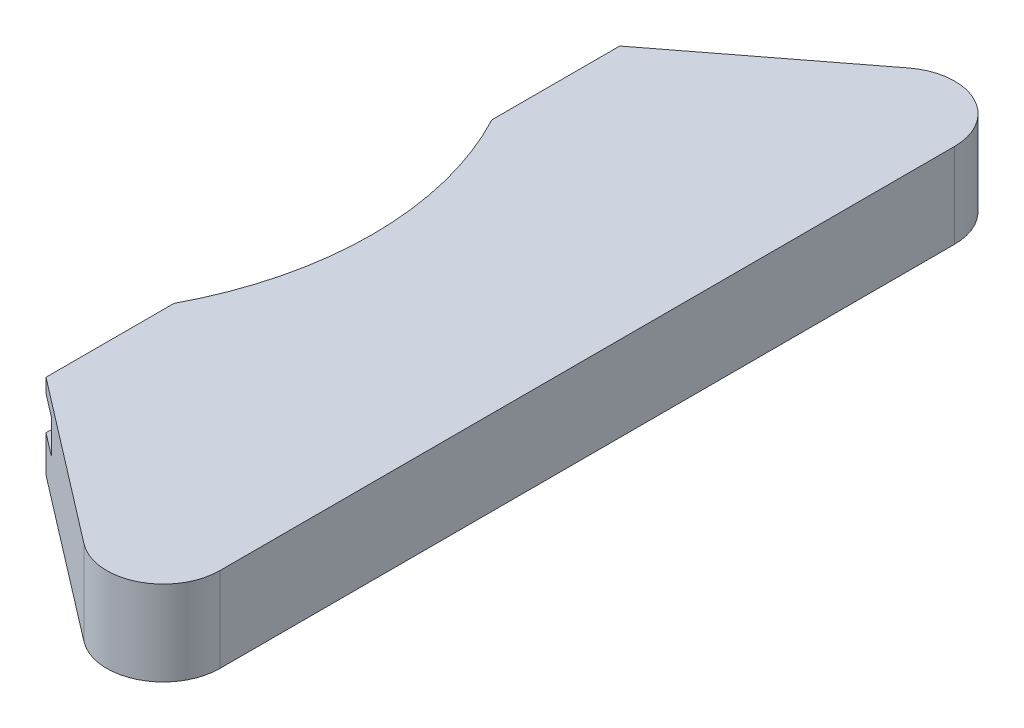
ISO-10303-21;
HEADER;
FILE_DESCRIPTION(('STEP AP214'),'2;1');
FILE_NAME('part.step','',(''),(''),'','','');
FILE_SCHEMA(('AUTOMOTIVE_DESIGN { 1 0 10303 214 1 1 1 1 }'));
ENDSEC;
DATA;
#1=APPLICATION_CONTEXT('core data for automotive mechanical design processes');
#2=APPLICATION_PROTOCOL_DEFINITION('international standard','automotive_design',2000,#1);
#3=PRODUCT_CONTEXT('',#1,'mechanical');
#4=PRODUCT('Part','Part','',(#3));
#5=PRODUCT_RELATED_PRODUCT_CATEGORY('part','',(#4));
#6=PRODUCT_DEFINITION_FORMATION('','',#4);
#7=PRODUCT_DEFINITION_CONTEXT('part definition',#1,'design');
#8=PRODUCT_DEFINITION('design','',#6,#7);
#9=PRODUCT_DEFINITION_SHAPE('','',#8);
#10=(LENGTH_UNIT() NAMED_UNIT(*) SI_UNIT(.MILLI.,.METRE.));
#11=(NAMED_UNIT(*) PLANE_ANGLE_UNIT() SI_UNIT($,.RADIAN.));
#12=(NAMED_UNIT(*) SI_UNIT($,.STERADIAN.) SOLID_ANGLE_UNIT());
#13=UNCERTAINTY_MEASURE_WITH_UNIT(LENGTH_MEASURE(1.E-05),#10,'distance_accuracy_value','');
#14=(GEOMETRIC_REPRESENTATION_CONTEXT(3) GLOBAL_UNCERTAINTY_ASSIGNED_CONTEXT((#13)) GLOBAL_UNIT_ASSIGNED_CONTEXT((#10,
#11,#12)) REPRESENTATION_CONTEXT('',''));
#15=CARTESIAN_POINT('',(0.,0.,0.));
#16=DIRECTION('',(0.,0.,1.));
#17=DIRECTION('',(1.,0.,0.));
#18=AXIS2_PLACEMENT_3D('',#15,#16,#17);
#19=CARTESIAN_POINT('',(-45.,7.5,28.1247222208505));
#20=DIRECTION('',(1.,0.,0.));
#21=DIRECTION('',(0.,0.,-1.));
#22=AXIS2_PLACEMENT_3D('',#19,#20,#21);
#23=PLANE('',#22);
#24=DIRECTION('',(0.,0.,1.));
#25=VECTOR('',#24,1.);
#26=CARTESIAN_POINT('',(-45.,-0.999999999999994,33.5516192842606));
#27=LINE('',#26,#25);
#28=CARTESIAN_POINT('',(-45.,-0.999999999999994,33.5516192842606));
#29=VERTEX_POINT('',#28);
#30=CARTESIAN_POINT('',(-45.,-0.999999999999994,50.748279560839));
#31=VERTEX_POINT('',#30);
#32=EDGE_CURVE('E144',#29,#31,#27,.T.);
#33=ORIENTED_EDGE('',*,*,#32,.F.);
#34=CARTESIAN_POINT('',(-45.,2.,33.5516192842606));
#35=DIRECTION('',(1.,0.,0.));
#36=DIRECTION('',(0.,0.,-1.));
#37=AXIS2_PLACEMENT_3D('',#34,#35,#36);
#38=ELLIPSE('',#37,3.10582854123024,2.99999999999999);
#39=CARTESIAN_POINT('',(-45.,4.99999999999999,33.5516192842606));
#40=VERTEX_POINT('',#39);
#41=EDGE_CURVE('E11',#40,#29,#38,.F.);
#42=ORIENTED_EDGE('',*,*,#41,.F.);
#43=DIRECTION('',(0.,0.,1.));
#44=VECTOR('',#43,1.);
#45=CARTESIAN_POINT('',(-45.,4.99999999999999,33.5516192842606));
#46=LINE('',#45,#44);
#47=CARTESIAN_POINT('',(-45.,4.99999999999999,50.748279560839));
#48=VERTEX_POINT('',#47);
#49=EDGE_CURVE('E121',#40,#48,#46,.T.);
#50=ORIENTED_EDGE('',*,*,#49,.T.);
#51=DIRECTION('',(0.,-1.,0.));
#52=VECTOR('',#51,1.);
#53=CARTESIAN_POINT('',(-45.,7.5,50.748279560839));
#54=LINE('',#53,#52);
#55=CARTESIAN_POINT('',(-45.,7.5,50.748279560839));
#56=VERTEX_POINT('',#55);
#57=EDGE_CURVE('E210',#56,#48,#54,.T.);
#58=ORIENTED_EDGE('',*,*,#57,.F.);
#59=DIRECTION('',(0.,0.,1.));
#60=VECTOR('',#59,1.);
#61=CARTESIAN_POINT('',(-45.,7.5,28.1247222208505));
#62=LINE('',#61,#60);
#63=CARTESIAN_POINT('',(-45.,7.5,28.1247222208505));
#64=VERTEX_POINT('',#63);
#65=EDGE_CURVE('E180',#64,#56,#62,.T.);
#66=ORIENTED_EDGE('',*,*,#65,.F.);
#67=DIRECTION('',(0.,-1.,0.));
#68=VECTOR('',#67,1.);
#69=CARTESIAN_POINT('',(-45.,7.5,28.1247222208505));
#70=LINE('',#69,#68);
#71=CARTESIAN_POINT('',(-45.,-7.5,28.1247222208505));
#72=VERTEX_POINT('',#71);
#73=EDGE_CURVE('E41',#64,#72,#70,.T.);
#74=ORIENTED_EDGE('',*,*,#73,.T.);
#75=DIRECTION('',(0.,0.,1.));
#76=VECTOR('',#75,1.);
#77=CARTESIAN_POINT('',(-45.,-7.5,28.1247222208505));
#78=LINE('',#77,#76);
#79=CARTESIAN_POINT('',(-45.,-7.5,50.748279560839));
#80=VERTEX_POINT('',#79);
#81=EDGE_CURVE('E164',#72,#80,#78,.T.);
#82=ORIENTED_EDGE('',*,*,#81,.T.);
#83=EDGE_CURVE('E146',#31,#80,#54,.T.);
#84=ORIENTED_EDGE('',*,*,#83,.F.);
#85=EDGE_LOOP('',(#33,#42,#50,#58,#66,#74,#82,#84));
#86=FACE_BOUND('',#85,.T.);
#87=ADVANCED_FACE('F31',(#86),#23,.F.);
#88=CARTESIAN_POINT('',(-45.,7.5,50.748279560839));
#89=DIRECTION('',(0.608761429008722,0.,-0.793353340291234));
#90=DIRECTION('',(-0.793353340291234,0.,-0.608761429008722));
#91=AXIS2_PLACEMENT_3D('',#88,#89,#90);
#92=PLANE('',#91);
#93=DIRECTION('',(0.793353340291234,0.,0.608761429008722));
#94=VECTOR('',#93,1.);
#95=CARTESIAN_POINT('',(-45.,-0.999999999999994,50.748279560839));
#96=LINE('',#95,#94);
#97=CARTESIAN_POINT('',(-41.,-0.999999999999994,53.8175875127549));
#98=VERTEX_POINT('',#97);
#99=EDGE_CURVE('E149',#31,#98,#96,.T.);
#100=ORIENTED_EDGE('',*,*,#99,.F.);
#101=ORIENTED_EDGE('',*,*,#83,.T.);
#102=DIRECTION('',(0.793353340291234,0.,0.608761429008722));
#103=VECTOR('',#102,1.);
#104=CARTESIAN_POINT('',(-45.,-7.5,50.748279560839));
#105=LINE('',#104,#103);
#106=CARTESIAN_POINT('',(-16.0876142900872,-7.5,72.9335334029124));
#107=VERTEX_POINT('',#106);
#108=EDGE_CURVE('E166',#80,#107,#105,.T.);
#109=ORIENTED_EDGE('',*,*,#108,.T.);
#110=DIRECTION('',(0.,-1.,0.));
#111=VECTOR('',#110,1.);
#112=CARTESIAN_POINT('',(-16.0876142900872,7.5,72.9335334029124));
#113=LINE('',#112,#111);
#114=CARTESIAN_POINT('',(-16.0876142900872,7.5,72.9335334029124));
#115=VERTEX_POINT('',#114);
#116=EDGE_CURVE('E207',#115,#107,#113,.T.);
#117=ORIENTED_EDGE('',*,*,#116,.F.);
#118=DIRECTION('',(0.793353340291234,0.,0.608761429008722));
#119=VECTOR('',#118,1.);
#120=CARTESIAN_POINT('',(-45.,7.5,50.748279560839));
#121=LINE('',#120,#119);
#122=EDGE_CURVE('E182',#56,#115,#121,.T.);
#123=ORIENTED_EDGE('',*,*,#122,.F.);
#124=ORIENTED_EDGE('',*,*,#57,.T.);
#125=DIRECTION('',(0.793353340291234,0.,0.608761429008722));
#126=VECTOR('',#125,1.);
#127=CARTESIAN_POINT('',(-45.,4.99999999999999,50.748279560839));
#128=LINE('',#127,#126);
#129=CARTESIAN_POINT('',(-41.,4.99999999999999,53.8175875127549));
#130=VERTEX_POINT('',#129);
#131=EDGE_CURVE('E128',#48,#130,#128,.T.);
#132=ORIENTED_EDGE('',*,*,#131,.T.);
#133=DIRECTION('',(0.,1.,0.));
#134=VECTOR('',#133,1.);
#135=CARTESIAN_POINT('',(-41.,-0.999999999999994,53.8175875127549));
#136=LINE('',#135,#134);
#137=EDGE_CURVE('E158',#98,#130,#136,.T.);
#138=ORIENTED_EDGE('',*,*,#137,.F.);
#139=EDGE_LOOP('',(#100,#101,#109,#117,#123,#124,#132,#138));
#140=FACE_BOUND('',#139,.T.);
#141=ADVANCED_FACE('F226',(#140),#92,.F.);
#142=CARTESIAN_POINT('',(-98.,7.5,0.));
#143=DIRECTION('',(0.,-1.,0.));
#144=DIRECTION('',(0.,0.,-1.));
#145=AXIS2_PLACEMENT_3D('',#142,#143,#144);
#146=CYLINDRICAL_SURFACE('',#145,60.);
#147=CARTESIAN_POINT('',(-98.,-7.5,0.));
#148=DIRECTION('',(0.,-1.,0.));
#149=DIRECTION('',(0.,0.,1.));
#150=AXIS2_PLACEMENT_3D('',#147,#148,#149);
#151=CIRCLE('',#150,60.);
#152=CARTESIAN_POINT('',(-45.,-7.5,-28.1247222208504));
#153=VERTEX_POINT('',#152);
#154=EDGE_CURVE('E139',#153,#72,#151,.T.);
#155=ORIENTED_EDGE('',*,*,#154,.T.);
#156=ORIENTED_EDGE('',*,*,#73,.F.);
#157=CARTESIAN_POINT('',(-98.,7.5,0.));
#158=DIRECTION('',(0.,-1.,0.));
#159=DIRECTION('',(0.,0.,1.));
#160=AXIS2_PLACEMENT_3D('',#157,#158,#159);
#161=CIRCLE('',#160,60.);
#162=CARTESIAN_POINT('',(-45.,7.5,-28.1247222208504));
#163=VERTEX_POINT('',#162);
#164=EDGE_CURVE('E178',#163,#64,#161,.T.);
#165=ORIENTED_EDGE('',*,*,#164,.F.);
#166=DIRECTION('',(0.,-1.,0.));
#167=VECTOR('',#166,1.);
#168=CARTESIAN_POINT('',(-45.,7.5,-28.1247222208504));
#169=LINE('',#168,#167);
#170=EDGE_CURVE('E192',#163,#153,#169,.T.);
#171=ORIENTED_EDGE('',*,*,#170,.T.);
#172=EDGE_LOOP('',(#155,#156,#165,#171));
#173=FACE_BOUND('',#172,.T.);
#174=ADVANCED_FACE('F33',(#173),#146,.F.);
#175=CARTESIAN_POINT('',(-10.,7.5,65.));
#176=DIRECTION('',(0.,-1.,0.));
#177=DIRECTION('',(0.,0.,-1.));
#178=AXIS2_PLACEMENT_3D('',#175,#176,#177);
#179=CYLINDRICAL_SURFACE('',#178,10.);
#180=CARTESIAN_POINT('',(-10.,-7.5,65.));
#181=DIRECTION('',(0.,1.,0.));
#182=DIRECTION('',(0.,0.,1.));
#183=AXIS2_PLACEMENT_3D('',#180,#181,#182);
#184=CIRCLE('',#183,10.);
#185=CARTESIAN_POINT('',(0.,-7.5,65.));
#186=VERTEX_POINT('',#185);
#187=EDGE_CURVE('E168',#107,#186,#184,.T.);
#188=ORIENTED_EDGE('',*,*,#187,.T.);
#189=DIRECTION('',(0.,-1.,0.));
#190=VECTOR('',#189,1.);
#191=CARTESIAN_POINT('',(0.,7.5,65.));
#192=LINE('',#191,#190);
#193=CARTESIAN_POINT('',(0.,7.5,65.));
#194=VERTEX_POINT('',#193);
#195=EDGE_CURVE('E204',#194,#186,#192,.T.);
#196=ORIENTED_EDGE('',*,*,#195,.F.);
#197=CARTESIAN_POINT('',(-10.,7.5,65.));
#198=DIRECTION('',(0.,1.,0.));
#199=DIRECTION('',(0.,0.,1.));
#200=AXIS2_PLACEMENT_3D('',#197,#198,#199);
#201=CIRCLE('',#200,10.);
#202=EDGE_CURVE('E184',#115,#194,#201,.T.);
#203=ORIENTED_EDGE('',*,*,#202,.F.);
#204=ORIENTED_EDGE('',*,*,#116,.T.);
#205=EDGE_LOOP('',(#188,#196,#203,#204));
#206=FACE_BOUND('',#205,.T.);
#207=ADVANCED_FACE('F230',(#206),#179,.T.);
#208=CARTESIAN_POINT('',(0.,7.5,65.));
#209=DIRECTION('',(-1.,0.,0.));
#210=DIRECTION('',(0.,0.,1.));
#211=AXIS2_PLACEMENT_3D('',#208,#209,#210);
#212=PLANE('',#211);
#213=DIRECTION('',(0.,0.,-1.));
#214=VECTOR('',#213,1.);
#215=CARTESIAN_POINT('',(0.,-7.5,65.));
#216=LINE('',#215,#214);
#217=CARTESIAN_POINT('',(0.,-7.5,-65.));
#218=VERTEX_POINT('',#217);
#219=EDGE_CURVE('E170',#186,#218,#216,.T.);
#220=ORIENTED_EDGE('',*,*,#219,.T.);
#221=DIRECTION('',(0.,-1.,0.));
#222=VECTOR('',#221,1.);
#223=CARTESIAN_POINT('',(0.,7.5,-65.));
#224=LINE('',#223,#222);
#225=CARTESIAN_POINT('',(0.,7.5,-65.));
#226=VERTEX_POINT('',#225);
#227=EDGE_CURVE('E201',#226,#218,#224,.T.);
#228=ORIENTED_EDGE('',*,*,#227,.F.);
#229=DIRECTION('',(0.,0.,-1.));
#230=VECTOR('',#229,1.);
#231=CARTESIAN_POINT('',(0.,7.5,65.));
#232=LINE('',#231,#230);
#233=EDGE_CURVE('E186',#194,#226,#232,.T.);
#234=ORIENTED_EDGE('',*,*,#233,.F.);
#235=ORIENTED_EDGE('',*,*,#195,.T.);
#236=EDGE_LOOP('',(#220,#228,#234,#235));
#237=FACE_BOUND('',#236,.T.);
#238=ADVANCED_FACE('F256',(#237),#212,.F.);
#239=CARTESIAN_POINT('',(-10.,7.5,-65.));
#240=DIRECTION('',(0.,-1.,0.));
#241=DIRECTION('',(0.,0.,-1.));
#242=AXIS2_PLACEMENT_3D('',#239,#240,#241);
#243=CYLINDRICAL_SURFACE('',#242,10.);
#244=CARTESIAN_POINT('',(-10.,-7.5,-65.));
#245=DIRECTION('',(0.,1.,0.));
#246=DIRECTION('',(0.,0.,-1.));
#247=AXIS2_PLACEMENT_3D('',#244,#245,#246);
#248=CIRCLE('',#247,10.);
#249=CARTESIAN_POINT('',(-16.0876142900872,-7.5,-72.9335334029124));
#250=VERTEX_POINT('',#249);
#251=EDGE_CURVE('E172',#218,#250,#248,.T.);
#252=ORIENTED_EDGE('',*,*,#251,.T.);
#253=DIRECTION('',(0.,-1.,0.));
#254=VECTOR('',#253,1.);
#255=CARTESIAN_POINT('',(-16.0876142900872,7.5,-72.9335334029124));
#256=LINE('',#255,#254);
#257=CARTESIAN_POINT('',(-16.0876142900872,7.5,-72.9335334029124));
#258=VERTEX_POINT('',#257);
#259=EDGE_CURVE('E198',#258,#250,#256,.T.);
#260=ORIENTED_EDGE('',*,*,#259,.F.);
#261=CARTESIAN_POINT('',(-10.,7.5,-65.));
#262=DIRECTION('',(0.,1.,0.));
#263=DIRECTION('',(0.,0.,-1.));
#264=AXIS2_PLACEMENT_3D('',#261,#262,#263);
#265=CIRCLE('',#264,10.);
#266=EDGE_CURVE('E188',#226,#258,#265,.T.);
#267=ORIENTED_EDGE('',*,*,#266,.F.);
#268=ORIENTED_EDGE('',*,*,#227,.T.);
#269=EDGE_LOOP('',(#252,#260,#267,#268));
#270=FACE_BOUND('',#269,.T.);
#271=ADVANCED_FACE('F259',(#270),#243,.T.);
#272=CARTESIAN_POINT('',(-45.,7.5,-50.748279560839));
#273=DIRECTION('',(0.608761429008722,0.,0.793353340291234));
#274=DIRECTION('',(0.793353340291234,0.,-0.608761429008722));
#275=AXIS2_PLACEMENT_3D('',#272,#273,#274);
#276=PLANE('',#275);
#277=DIRECTION('',(-0.793353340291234,0.,0.608761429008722));
#278=VECTOR('',#277,1.);
#279=CARTESIAN_POINT('',(-45.,-7.5,-50.748279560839));
#280=LINE('',#279,#278);
#281=CARTESIAN_POINT('',(-45.,-7.5,-50.748279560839));
#282=VERTEX_POINT('',#281);
#283=EDGE_CURVE('E174',#250,#282,#280,.T.);
#284=ORIENTED_EDGE('',*,*,#283,.T.);
#285=DIRECTION('',(0.,-1.,0.));
#286=VECTOR('',#285,1.);
#287=CARTESIAN_POINT('',(-45.,7.5,-50.748279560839));
#288=LINE('',#287,#286);
#289=CARTESIAN_POINT('',(-45.,7.5,-50.748279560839));
#290=VERTEX_POINT('',#289);
#291=EDGE_CURVE('E195',#290,#282,#288,.T.);
#292=ORIENTED_EDGE('',*,*,#291,.F.);
#293=DIRECTION('',(-0.793353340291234,0.,0.608761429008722));
#294=VECTOR('',#293,1.);
#295=CARTESIAN_POINT('',(-45.,7.5,-50.748279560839));
#296=LINE('',#295,#294);
#297=EDGE_CURVE('E53',#258,#290,#296,.T.);
#298=ORIENTED_EDGE('',*,*,#297,.F.);
#299=ORIENTED_EDGE('',*,*,#259,.T.);
#300=EDGE_LOOP('',(#284,#292,#298,#299));
#301=FACE_BOUND('',#300,.T.);
#302=ADVANCED_FACE('F263',(#301),#276,.F.);
#303=CARTESIAN_POINT('',(-45.,7.5,-28.1247222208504));
#304=DIRECTION('',(1.,0.,0.));
#305=DIRECTION('',(0.,0.,-1.));
#306=AXIS2_PLACEMENT_3D('',#303,#304,#305);
#307=PLANE('',#306);
#308=DIRECTION('',(0.,0.,1.));
#309=VECTOR('',#308,1.);
#310=CARTESIAN_POINT('',(-45.,-7.5,-28.1247222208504));
#311=LINE('',#310,#309);
#312=EDGE_CURVE('E176',#282,#153,#311,.T.);
#313=ORIENTED_EDGE('',*,*,#312,.T.);
#314=ORIENTED_EDGE('',*,*,#170,.F.);
#315=DIRECTION('',(0.,0.,1.));
#316=VECTOR('',#315,1.);
#317=CARTESIAN_POINT('',(-45.,7.5,-28.1247222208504));
#318=LINE('',#317,#316);
#319=EDGE_CURVE('E48',#290,#163,#318,.T.);
#320=ORIENTED_EDGE('',*,*,#319,.F.);
#321=ORIENTED_EDGE('',*,*,#291,.T.);
#322=EDGE_LOOP('',(#313,#314,#320,#321));
#323=FACE_BOUND('',#322,.T.);
#324=ADVANCED_FACE('F267',(#323),#307,.F.);
#325=CARTESIAN_POINT('',(-98.,7.5,0.));
#326=DIRECTION('',(0.,1.,0.));
#327=DIRECTION('',(0.,0.,1.));
#328=AXIS2_PLACEMENT_3D('',#325,#326,#327);
#329=PLANE('',#328);
#330=ORIENTED_EDGE('',*,*,#164,.T.);
#331=ORIENTED_EDGE('',*,*,#65,.T.);
#332=ORIENTED_EDGE('',*,*,#122,.T.);
#333=ORIENTED_EDGE('',*,*,#202,.T.);
#334=ORIENTED_EDGE('',*,*,#233,.T.);
#335=ORIENTED_EDGE('',*,*,#266,.T.);
#336=ORIENTED_EDGE('',*,*,#297,.T.);
#337=ORIENTED_EDGE('',*,*,#319,.T.);
#338=EDGE_LOOP('',(#330,#331,#332,#333,#334,#335,#336,#337));
#339=FACE_BOUND('',#338,.T.);
#340=ADVANCED_FACE('F233',(#339),#329,.T.);
#341=CARTESIAN_POINT('',(-98.,-7.5,0.));
#342=DIRECTION('',(0.,1.,0.));
#343=DIRECTION('',(0.,0.,1.));
#344=AXIS2_PLACEMENT_3D('',#341,#342,#343);
#345=PLANE('',#344);
#346=ORIENTED_EDGE('',*,*,#154,.F.);
#347=ORIENTED_EDGE('',*,*,#312,.F.);
#348=ORIENTED_EDGE('',*,*,#283,.F.);
#349=ORIENTED_EDGE('',*,*,#251,.F.);
#350=ORIENTED_EDGE('',*,*,#219,.F.);
#351=ORIENTED_EDGE('',*,*,#187,.F.);
#352=ORIENTED_EDGE('',*,*,#108,.F.);
#353=ORIENTED_EDGE('',*,*,#81,.F.);
#354=EDGE_LOOP('',(#346,#347,#348,#349,#350,#351,#352,#353));
#355=FACE_BOUND('',#354,.T.);
#356=ADVANCED_FACE('F220',(#355),#345,.F.);
#357=CARTESIAN_POINT('',(-41.7764571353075,2.,34.415364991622));
#358=DIRECTION('',(-0.965925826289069,0.,-0.258819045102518));
#359=DIRECTION('',(-0.258819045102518,0.,0.965925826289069));
#360=AXIS2_PLACEMENT_3D('',#357,#358,#359);
#361=CYLINDRICAL_SURFACE('',#360,2.99999999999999);
#362=ORIENTED_EDGE('',*,*,#41,.T.);
#363=DIRECTION('',(-0.965925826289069,0.,-0.258819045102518));
#364=VECTOR('',#363,1.);
#365=CARTESIAN_POINT('',(-41.7764571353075,-0.999999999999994,34.4153649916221));
#366=LINE('',#365,#364);
#367=CARTESIAN_POINT('',(-41.,-0.999999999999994,34.6234160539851));
#368=VERTEX_POINT('',#367);
#369=EDGE_CURVE('E140',#368,#29,#366,.T.);
#370=ORIENTED_EDGE('',*,*,#369,.F.);
#371=CARTESIAN_POINT('',(-41.,2.,34.6234160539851));
#372=DIRECTION('',(-1.,0.,0.));
#373=DIRECTION('',(0.,0.,-1.));
#374=AXIS2_PLACEMENT_3D('',#371,#372,#373);
#375=ELLIPSE('',#374,3.10582854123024,2.99999999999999);
#376=CARTESIAN_POINT('',(-41.,4.99999999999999,34.6234160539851));
#377=VERTEX_POINT('',#376);
#378=EDGE_CURVE('E35',#368,#377,#375,.F.);
#379=ORIENTED_EDGE('',*,*,#378,.T.);
#380=DIRECTION('',(-0.965925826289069,0.,-0.258819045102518));
#381=VECTOR('',#380,1.);
#382=CARTESIAN_POINT('',(-41.7764571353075,4.99999999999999,34.4153649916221));
#383=LINE('',#382,#381);
#384=EDGE_CURVE('E125',#377,#40,#383,.T.);
#385=ORIENTED_EDGE('',*,*,#384,.T.);
#386=EDGE_LOOP('',(#362,#370,#379,#385));
#387=FACE_BOUND('',#386,.T.);
#388=ADVANCED_FACE('F136',(#387),#361,.F.);
#389=CARTESIAN_POINT('',(-41.,0.,0.));
#390=DIRECTION('',(-1.,0.,0.));
#391=DIRECTION('',(0.,0.,1.));
#392=AXIS2_PLACEMENT_3D('',#389,#390,#391);
#393=PLANE('',#392);
#394=ORIENTED_EDGE('',*,*,#378,.F.);
#395=DIRECTION('',(0.,0.,-1.));
#396=VECTOR('',#395,1.);
#397=CARTESIAN_POINT('',(-41.,-0.999999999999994,53.8175875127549));
#398=LINE('',#397,#396);
#399=EDGE_CURVE('E152',#98,#368,#398,.T.);
#400=ORIENTED_EDGE('',*,*,#399,.F.);
#401=ORIENTED_EDGE('',*,*,#137,.T.);
#402=DIRECTION('',(0.,0.,-1.));
#403=VECTOR('',#402,1.);
#404=CARTESIAN_POINT('',(-41.,4.99999999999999,53.8175875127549));
#405=LINE('',#404,#403);
#406=EDGE_CURVE('E150',#130,#377,#405,.T.);
#407=ORIENTED_EDGE('',*,*,#406,.T.);
#408=EDGE_LOOP('',(#394,#400,#401,#407));
#409=FACE_BOUND('',#408,.T.);
#410=ADVANCED_FACE('F238',(#409),#393,.T.);
#411=CARTESIAN_POINT('',(-45.,-0.999999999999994,33.5516192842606));
#412=DIRECTION('',(0.,1.,0.));
#413=DIRECTION('',(0.,0.,1.));
#414=AXIS2_PLACEMENT_3D('',#411,#412,#413);
#415=PLANE('',#414);
#416=ORIENTED_EDGE('',*,*,#369,.T.);
#417=ORIENTED_EDGE('',*,*,#32,.T.);
#418=ORIENTED_EDGE('',*,*,#99,.T.);
#419=ORIENTED_EDGE('',*,*,#399,.T.);
#420=EDGE_LOOP('',(#416,#417,#418,#419));
#421=FACE_BOUND('',#420,.T.);
#422=ADVANCED_FACE('F239',(#421),#415,.T.);
#423=CARTESIAN_POINT('',(-45.,4.99999999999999,33.5516192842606));
#424=DIRECTION('',(0.,1.,0.));
#425=DIRECTION('',(0.,0.,1.));
#426=AXIS2_PLACEMENT_3D('',#423,#424,#425);
#427=PLANE('',#426);
#428=ORIENTED_EDGE('',*,*,#384,.F.);
#429=ORIENTED_EDGE('',*,*,#406,.F.);
#430=ORIENTED_EDGE('',*,*,#131,.F.);
#431=ORIENTED_EDGE('',*,*,#49,.F.);
#432=EDGE_LOOP('',(#428,#429,#430,#431));
#433=FACE_BOUND('',#432,.T.);
#434=ADVANCED_FACE('F123',(#433),#427,.F.);
#435=CLOSED_SHELL('',(#87,#141,#174,#207,#238,#271,#302,#324,#340,#356,#388,#410,#422,#434));
#436=MANIFOLD_SOLID_BREP('B2',#435);
#437=ADVANCED_BREP_SHAPE_REPRESENTATION('',(#18,#436),#14);
#438=SHAPE_DEFINITION_REPRESENTATION(#9,#437);
ENDSEC;
END-ISO-10303-21;
